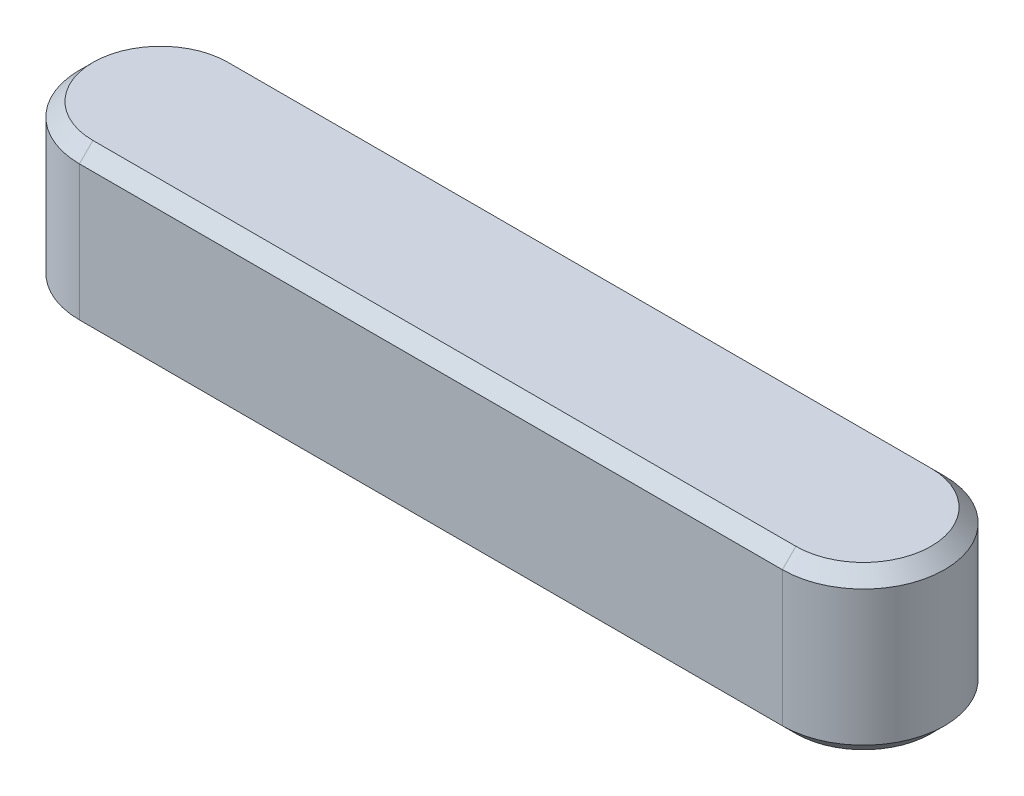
ISO-10303-21;
HEADER;
FILE_DESCRIPTION(('STEP AP214'),'2;1');
FILE_NAME('part.step','',(''),(''),'','','');
FILE_SCHEMA(('AUTOMOTIVE_DESIGN { 1 0 10303 214 1 1 1 1 }'));
ENDSEC;
DATA;
#1=APPLICATION_CONTEXT('core data for automotive mechanical design processes');
#2=APPLICATION_PROTOCOL_DEFINITION('international standard','automotive_design',2000,#1);
#3=PRODUCT_CONTEXT('',#1,'mechanical');
#4=PRODUCT('Part','Part','',(#3));
#5=PRODUCT_RELATED_PRODUCT_CATEGORY('part','',(#4));
#6=PRODUCT_DEFINITION_FORMATION('','',#4);
#7=PRODUCT_DEFINITION_CONTEXT('part definition',#1,'design');
#8=PRODUCT_DEFINITION('design','',#6,#7);
#9=PRODUCT_DEFINITION_SHAPE('','',#8);
#10=(LENGTH_UNIT() NAMED_UNIT(*) SI_UNIT(.MILLI.,.METRE.));
#11=(NAMED_UNIT(*) PLANE_ANGLE_UNIT() SI_UNIT($,.RADIAN.));
#12=(NAMED_UNIT(*) SI_UNIT($,.STERADIAN.) SOLID_ANGLE_UNIT());
#13=UNCERTAINTY_MEASURE_WITH_UNIT(LENGTH_MEASURE(1.E-05),#10,'distance_accuracy_value','');
#14=(GEOMETRIC_REPRESENTATION_CONTEXT(3) GLOBAL_UNCERTAINTY_ASSIGNED_CONTEXT((#13)) GLOBAL_UNIT_ASSIGNED_CONTEXT((#10,
#11,#12)) REPRESENTATION_CONTEXT('',''));
#15=CARTESIAN_POINT('',(0.,0.,0.));
#16=DIRECTION('',(0.,0.,1.));
#17=DIRECTION('',(1.,0.,0.));
#18=AXIS2_PLACEMENT_3D('',#15,#16,#17);
#19=CARTESIAN_POINT('',(13.,6.,0.));
#20=DIRECTION('',(0.,-1.,0.));
#21=DIRECTION('',(0.,0.,-1.));
#22=AXIS2_PLACEMENT_3D('',#19,#20,#21);
#23=CYLINDRICAL_SURFACE('',#22,2.99999999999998);
#24=DIRECTION('',(0.,-1.,0.));
#25=VECTOR('',#24,1.);
#26=CARTESIAN_POINT('',(13.,6.,-2.99999999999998));
#27=LINE('',#26,#25);
#28=CARTESIAN_POINT('',(13.,5.49999999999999,-2.99999999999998));
#29=VERTEX_POINT('',#28);
#30=CARTESIAN_POINT('',(13.,0.500000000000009,-2.99999999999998));
#31=VERTEX_POINT('',#30);
#32=EDGE_CURVE('E110',#29,#31,#27,.T.);
#33=ORIENTED_EDGE('',*,*,#32,.F.);
#34=CARTESIAN_POINT('',(13.,5.49999999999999,0.));
#35=DIRECTION('',(0.,-1.,0.));
#36=DIRECTION('',(0.,0.,-1.));
#37=AXIS2_PLACEMENT_3D('',#34,#35,#36);
#38=CIRCLE('',#37,2.99999999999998);
#39=CARTESIAN_POINT('',(13.,5.49999999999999,2.99999999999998));
#40=VERTEX_POINT('',#39);
#41=EDGE_CURVE('E134',#29,#40,#38,.T.);
#42=ORIENTED_EDGE('',*,*,#41,.T.);
#43=DIRECTION('',(0.,-1.,0.));
#44=VECTOR('',#43,1.);
#45=CARTESIAN_POINT('',(13.,6.,2.99999999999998));
#46=LINE('',#45,#44);
#47=CARTESIAN_POINT('',(13.,0.500000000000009,2.99999999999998));
#48=VERTEX_POINT('',#47);
#49=EDGE_CURVE('E161',#40,#48,#46,.T.);
#50=ORIENTED_EDGE('',*,*,#49,.T.);
#51=CARTESIAN_POINT('',(13.,0.500000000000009,0.));
#52=DIRECTION('',(0.,-1.,0.));
#53=DIRECTION('',(0.,0.,-1.));
#54=AXIS2_PLACEMENT_3D('',#51,#52,#53);
#55=CIRCLE('',#54,2.99999999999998);
#56=EDGE_CURVE('E132',#48,#31,#55,.F.);
#57=ORIENTED_EDGE('',*,*,#56,.T.);
#58=EDGE_LOOP('',(#33,#42,#50,#57));
#59=FACE_BOUND('',#58,.T.);
#60=ADVANCED_FACE('F27',(#59),#23,.T.);
#61=CARTESIAN_POINT('',(-13.,6.,-2.99999999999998));
#62=DIRECTION('',(0.,0.,1.));
#63=DIRECTION('',(1.,0.,0.));
#64=AXIS2_PLACEMENT_3D('',#61,#62,#63);
#65=PLANE('',#64);
#66=DIRECTION('',(0.,-1.,0.));
#67=VECTOR('',#66,1.);
#68=CARTESIAN_POINT('',(-13.,6.,-2.99999999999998));
#69=LINE('',#68,#67);
#70=CARTESIAN_POINT('',(-13.,5.5,-2.99999999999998));
#71=VERTEX_POINT('',#70);
#72=CARTESIAN_POINT('',(-13.,0.500000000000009,-2.99999999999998));
#73=VERTEX_POINT('',#72);
#74=EDGE_CURVE('E167',#71,#73,#69,.T.);
#75=ORIENTED_EDGE('',*,*,#74,.F.);
#76=DIRECTION('',(1.,0.,0.));
#77=VECTOR('',#76,1.);
#78=CARTESIAN_POINT('',(-13.,5.5,-2.99999999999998));
#79=LINE('',#78,#77);
#80=EDGE_CURVE('E130',#71,#29,#79,.T.);
#81=ORIENTED_EDGE('',*,*,#80,.T.);
#82=ORIENTED_EDGE('',*,*,#32,.T.);
#83=DIRECTION('',(-1.,0.,0.));
#84=VECTOR('',#83,1.);
#85=CARTESIAN_POINT('',(-13.,0.500000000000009,-2.99999999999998));
#86=LINE('',#85,#84);
#87=EDGE_CURVE('E127',#31,#73,#86,.T.);
#88=ORIENTED_EDGE('',*,*,#87,.T.);
#89=EDGE_LOOP('',(#75,#81,#82,#88));
#90=FACE_BOUND('',#89,.T.);
#91=ADVANCED_FACE('F192',(#90),#65,.F.);
#92=CARTESIAN_POINT('',(-13.,6.,0.));
#93=DIRECTION('',(0.,-1.,0.));
#94=DIRECTION('',(0.,0.,-1.));
#95=AXIS2_PLACEMENT_3D('',#92,#93,#94);
#96=CYLINDRICAL_SURFACE('',#95,2.99999999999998);
#97=DIRECTION('',(0.,-1.,0.));
#98=VECTOR('',#97,1.);
#99=CARTESIAN_POINT('',(-13.,6.,2.99999999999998));
#100=LINE('',#99,#98);
#101=CARTESIAN_POINT('',(-13.,5.5,2.99999999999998));
#102=VERTEX_POINT('',#101);
#103=CARTESIAN_POINT('',(-13.,0.500000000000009,2.99999999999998));
#104=VERTEX_POINT('',#103);
#105=EDGE_CURVE('E164',#102,#104,#100,.T.);
#106=ORIENTED_EDGE('',*,*,#105,.F.);
#107=CARTESIAN_POINT('',(-13.,5.5,0.));
#108=DIRECTION('',(0.,-1.,0.));
#109=DIRECTION('',(0.,0.,-1.));
#110=AXIS2_PLACEMENT_3D('',#107,#108,#109);
#111=CIRCLE('',#110,2.99999999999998);
#112=EDGE_CURVE('E125',#102,#71,#111,.T.);
#113=ORIENTED_EDGE('',*,*,#112,.T.);
#114=ORIENTED_EDGE('',*,*,#74,.T.);
#115=CARTESIAN_POINT('',(-13.,0.500000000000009,0.));
#116=DIRECTION('',(0.,-1.,0.));
#117=DIRECTION('',(0.,0.,-1.));
#118=AXIS2_PLACEMENT_3D('',#115,#116,#117);
#119=CIRCLE('',#118,2.99999999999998);
#120=EDGE_CURVE('E123',#73,#104,#119,.F.);
#121=ORIENTED_EDGE('',*,*,#120,.T.);
#122=EDGE_LOOP('',(#106,#113,#114,#121));
#123=FACE_BOUND('',#122,.T.);
#124=ADVANCED_FACE('F184',(#123),#96,.T.);
#125=CARTESIAN_POINT('',(-13.,6.,2.99999999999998));
#126=DIRECTION('',(0.,0.,-1.));
#127=DIRECTION('',(-1.,0.,0.));
#128=AXIS2_PLACEMENT_3D('',#125,#126,#127);
#129=PLANE('',#128);
#130=ORIENTED_EDGE('',*,*,#49,.F.);
#131=DIRECTION('',(-1.,0.,0.));
#132=VECTOR('',#131,1.);
#133=CARTESIAN_POINT('',(-13.,5.5,2.99999999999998));
#134=LINE('',#133,#132);
#135=EDGE_CURVE('E96',#40,#102,#134,.T.);
#136=ORIENTED_EDGE('',*,*,#135,.T.);
#137=ORIENTED_EDGE('',*,*,#105,.T.);
#138=DIRECTION('',(1.,0.,0.));
#139=VECTOR('',#138,1.);
#140=CARTESIAN_POINT('',(13.,0.500000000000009,2.99999999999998));
#141=LINE('',#140,#139);
#142=EDGE_CURVE('E116',#104,#48,#141,.T.);
#143=ORIENTED_EDGE('',*,*,#142,.T.);
#144=EDGE_LOOP('',(#130,#136,#137,#143));
#145=FACE_BOUND('',#144,.T.);
#146=ADVANCED_FACE('F183',(#145),#129,.F.);
#147=CARTESIAN_POINT('',(13.,6.,0.));
#148=DIRECTION('',(0.,-1.,0.));
#149=DIRECTION('',(0.,0.,-1.));
#150=AXIS2_PLACEMENT_3D('',#147,#148,#149);
#151=PLANE('',#150);
#152=CARTESIAN_POINT('',(-13.,6.,0.));
#153=DIRECTION('',(0.,-1.,0.));
#154=DIRECTION('',(0.,0.,-1.));
#155=AXIS2_PLACEMENT_3D('',#152,#153,#154);
#156=CIRCLE('',#155,2.49999999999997);
#157=CARTESIAN_POINT('',(-13.,6.,-2.49999999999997));
#158=VERTEX_POINT('',#157);
#159=CARTESIAN_POINT('',(-13.,6.,2.49999999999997));
#160=VERTEX_POINT('',#159);
#161=EDGE_CURVE('E114',#158,#160,#156,.F.);
#162=ORIENTED_EDGE('',*,*,#161,.T.);
#163=DIRECTION('',(1.,0.,0.));
#164=VECTOR('',#163,1.);
#165=CARTESIAN_POINT('',(13.,6.,2.49999999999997));
#166=LINE('',#165,#164);
#167=CARTESIAN_POINT('',(13.,6.,2.49999999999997));
#168=VERTEX_POINT('',#167);
#169=EDGE_CURVE('E94',#160,#168,#166,.T.);
#170=ORIENTED_EDGE('',*,*,#169,.T.);
#171=CARTESIAN_POINT('',(13.,6.,0.));
#172=DIRECTION('',(0.,-1.,0.));
#173=DIRECTION('',(0.,0.,-1.));
#174=AXIS2_PLACEMENT_3D('',#171,#172,#173);
#175=CIRCLE('',#174,2.49999999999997);
#176=CARTESIAN_POINT('',(13.,6.,-2.49999999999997));
#177=VERTEX_POINT('',#176);
#178=EDGE_CURVE('E103',#168,#177,#175,.F.);
#179=ORIENTED_EDGE('',*,*,#178,.T.);
#180=DIRECTION('',(-1.,0.,0.));
#181=VECTOR('',#180,1.);
#182=CARTESIAN_POINT('',(13.,6.,-2.49999999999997));
#183=LINE('',#182,#181);
#184=EDGE_CURVE('E109',#177,#158,#183,.T.);
#185=ORIENTED_EDGE('',*,*,#184,.T.);
#186=EDGE_LOOP('',(#162,#170,#179,#185));
#187=FACE_BOUND('',#186,.T.);
#188=ADVANCED_FACE('F112',(#187),#151,.F.);
#189=CARTESIAN_POINT('',(13.,0.,0.));
#190=DIRECTION('',(0.,-1.,0.));
#191=DIRECTION('',(0.,0.,-1.));
#192=AXIS2_PLACEMENT_3D('',#189,#190,#191);
#193=PLANE('',#192);
#194=CARTESIAN_POINT('',(-13.,0.,0.));
#195=DIRECTION('',(0.,-1.,0.));
#196=DIRECTION('',(0.,0.,-1.));
#197=AXIS2_PLACEMENT_3D('',#194,#195,#196);
#198=CIRCLE('',#197,2.49999999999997);
#199=CARTESIAN_POINT('',(-13.,0.,2.49999999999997));
#200=VERTEX_POINT('',#199);
#201=CARTESIAN_POINT('',(-13.,0.,-2.49999999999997));
#202=VERTEX_POINT('',#201);
#203=EDGE_CURVE('E34',#200,#202,#198,.T.);
#204=ORIENTED_EDGE('',*,*,#203,.T.);
#205=DIRECTION('',(1.,0.,0.));
#206=VECTOR('',#205,1.);
#207=CARTESIAN_POINT('',(13.,0.,-2.49999999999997));
#208=LINE('',#207,#206);
#209=CARTESIAN_POINT('',(13.,0.,-2.49999999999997));
#210=VERTEX_POINT('',#209);
#211=EDGE_CURVE('E11',#202,#210,#208,.T.);
#212=ORIENTED_EDGE('',*,*,#211,.T.);
#213=CARTESIAN_POINT('',(13.,0.,0.));
#214=DIRECTION('',(0.,-1.,0.));
#215=DIRECTION('',(0.,0.,-1.));
#216=AXIS2_PLACEMENT_3D('',#213,#214,#215);
#217=CIRCLE('',#216,2.49999999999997);
#218=CARTESIAN_POINT('',(13.,0.,2.49999999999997));
#219=VERTEX_POINT('',#218);
#220=EDGE_CURVE('E136',#210,#219,#217,.T.);
#221=ORIENTED_EDGE('',*,*,#220,.T.);
#222=DIRECTION('',(-1.,0.,0.));
#223=VECTOR('',#222,1.);
#224=CARTESIAN_POINT('',(-13.,0.,2.49999999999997));
#225=LINE('',#224,#223);
#226=EDGE_CURVE('E44',#219,#200,#225,.T.);
#227=ORIENTED_EDGE('',*,*,#226,.T.);
#228=EDGE_LOOP('',(#204,#212,#221,#227));
#229=FACE_BOUND('',#228,.T.);
#230=ADVANCED_FACE('F139',(#229),#193,.T.);
#231=CARTESIAN_POINT('',(13.,6.,-2.49999999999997));
#232=DIRECTION('',(0.,-0.707106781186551,0.707106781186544));
#233=DIRECTION('',(0.,-0.707106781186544,-0.707106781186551));
#234=AXIS2_PLACEMENT_3D('',#231,#232,#233);
#235=PLANE('',#234);
#236=DIRECTION('',(0.,0.707106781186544,0.707106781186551));
#237=VECTOR('',#236,1.);
#238=CARTESIAN_POINT('',(13.,5.5,-2.99999999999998));
#239=LINE('',#238,#237);
#240=EDGE_CURVE('E106',#29,#177,#239,.T.);
#241=ORIENTED_EDGE('',*,*,#240,.F.);
#242=ORIENTED_EDGE('',*,*,#80,.F.);
#243=DIRECTION('',(0.,-0.707106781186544,-0.707106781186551));
#244=VECTOR('',#243,1.);
#245=CARTESIAN_POINT('',(-13.,6.,-2.49999999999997));
#246=LINE('',#245,#244);
#247=EDGE_CURVE('E158',#158,#71,#246,.T.);
#248=ORIENTED_EDGE('',*,*,#247,.F.);
#249=ORIENTED_EDGE('',*,*,#184,.F.);
#250=EDGE_LOOP('',(#241,#242,#248,#249));
#251=FACE_BOUND('',#250,.T.);
#252=ADVANCED_FACE('F174',(#251),#235,.F.);
#253=CARTESIAN_POINT('',(-13.,6.,0.));
#254=DIRECTION('',(0.,-1.,0.));
#255=DIRECTION('',(0.,0.,-1.));
#256=AXIS2_PLACEMENT_3D('',#253,#254,#255);
#257=CONICAL_SURFACE('',#256,2.49999999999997,0.785398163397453);
#258=ORIENTED_EDGE('',*,*,#247,.T.);
#259=ORIENTED_EDGE('',*,*,#112,.F.);
#260=DIRECTION('',(0.,-0.707106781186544,0.707106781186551));
#261=VECTOR('',#260,1.);
#262=CARTESIAN_POINT('',(-13.,6.,2.49999999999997));
#263=LINE('',#262,#261);
#264=EDGE_CURVE('E99',#160,#102,#263,.T.);
#265=ORIENTED_EDGE('',*,*,#264,.F.);
#266=ORIENTED_EDGE('',*,*,#161,.F.);
#267=EDGE_LOOP('',(#258,#259,#265,#266));
#268=FACE_BOUND('',#267,.T.);
#269=ADVANCED_FACE('F177',(#268),#257,.T.);
#270=CARTESIAN_POINT('',(13.,6.,0.));
#271=DIRECTION('',(0.,-1.,0.));
#272=DIRECTION('',(0.,0.,-1.));
#273=AXIS2_PLACEMENT_3D('',#270,#271,#272);
#274=CONICAL_SURFACE('',#273,2.49999999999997,0.785398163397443);
#275=ORIENTED_EDGE('',*,*,#240,.T.);
#276=ORIENTED_EDGE('',*,*,#178,.F.);
#277=DIRECTION('',(0.,0.707106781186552,-0.707106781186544));
#278=VECTOR('',#277,1.);
#279=CARTESIAN_POINT('',(13.,5.49999999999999,2.99999999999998));
#280=LINE('',#279,#278);
#281=EDGE_CURVE('E90',#40,#168,#280,.T.);
#282=ORIENTED_EDGE('',*,*,#281,.F.);
#283=ORIENTED_EDGE('',*,*,#41,.F.);
#284=EDGE_LOOP('',(#275,#276,#282,#283));
#285=FACE_BOUND('',#284,.T.);
#286=ADVANCED_FACE('F104',(#285),#274,.T.);
#287=CARTESIAN_POINT('',(13.,6.,2.49999999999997));
#288=DIRECTION('',(0.,-0.707106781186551,-0.707106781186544));
#289=DIRECTION('',(0.,0.707106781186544,-0.707106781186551));
#290=AXIS2_PLACEMENT_3D('',#287,#288,#289);
#291=PLANE('',#290);
#292=ORIENTED_EDGE('',*,*,#264,.T.);
#293=ORIENTED_EDGE('',*,*,#135,.F.);
#294=ORIENTED_EDGE('',*,*,#281,.T.);
#295=ORIENTED_EDGE('',*,*,#169,.F.);
#296=EDGE_LOOP('',(#292,#293,#294,#295));
#297=FACE_BOUND('',#296,.T.);
#298=ADVANCED_FACE('F92',(#297),#291,.F.);
#299=CARTESIAN_POINT('',(-13.,0.500000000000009,2.99999999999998));
#300=DIRECTION('',(0.,-0.707106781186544,0.707106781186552));
#301=DIRECTION('',(0.,-0.707106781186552,-0.707106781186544));
#302=AXIS2_PLACEMENT_3D('',#299,#300,#301);
#303=PLANE('',#302);
#304=DIRECTION('',(0.,0.707106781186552,0.707106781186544));
#305=VECTOR('',#304,1.);
#306=CARTESIAN_POINT('',(-13.,0.,2.49999999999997));
#307=LINE('',#306,#305);
#308=EDGE_CURVE('E149',#200,#104,#307,.T.);
#309=ORIENTED_EDGE('',*,*,#308,.F.);
#310=ORIENTED_EDGE('',*,*,#226,.F.);
#311=DIRECTION('',(0.,-0.707106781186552,-0.707106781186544));
#312=VECTOR('',#311,1.);
#313=CARTESIAN_POINT('',(13.,0.500000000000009,2.99999999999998));
#314=LINE('',#313,#312);
#315=EDGE_CURVE('E100',#48,#219,#314,.T.);
#316=ORIENTED_EDGE('',*,*,#315,.F.);
#317=ORIENTED_EDGE('',*,*,#142,.F.);
#318=EDGE_LOOP('',(#309,#310,#316,#317));
#319=FACE_BOUND('',#318,.T.);
#320=ADVANCED_FACE('F145',(#319),#303,.T.);
#321=CARTESIAN_POINT('',(13.,0.500000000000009,0.));
#322=DIRECTION('',(0.,1.,0.));
#323=DIRECTION('',(0.,0.,1.));
#324=AXIS2_PLACEMENT_3D('',#321,#322,#323);
#325=CONICAL_SURFACE('',#324,2.99999999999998,0.785398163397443);
#326=ORIENTED_EDGE('',*,*,#315,.T.);
#327=ORIENTED_EDGE('',*,*,#220,.F.);
#328=DIRECTION('',(0.,-0.707106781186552,0.707106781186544));
#329=VECTOR('',#328,1.);
#330=CARTESIAN_POINT('',(13.,0.500000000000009,-2.99999999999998));
#331=LINE('',#330,#329);
#332=EDGE_CURVE('E152',#31,#210,#331,.T.);
#333=ORIENTED_EDGE('',*,*,#332,.F.);
#334=ORIENTED_EDGE('',*,*,#56,.F.);
#335=EDGE_LOOP('',(#326,#327,#333,#334));
#336=FACE_BOUND('',#335,.T.);
#337=ADVANCED_FACE('F150',(#336),#325,.T.);
#338=CARTESIAN_POINT('',(-13.,0.500000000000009,0.));
#339=DIRECTION('',(0.,1.,0.));
#340=DIRECTION('',(0.,0.,1.));
#341=AXIS2_PLACEMENT_3D('',#338,#339,#340);
#342=CONICAL_SURFACE('',#341,2.99999999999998,0.785398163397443);
#343=ORIENTED_EDGE('',*,*,#308,.T.);
#344=ORIENTED_EDGE('',*,*,#120,.F.);
#345=DIRECTION('',(0.,0.707106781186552,-0.707106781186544));
#346=VECTOR('',#345,1.);
#347=CARTESIAN_POINT('',(-13.,0.,-2.49999999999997));
#348=LINE('',#347,#346);
#349=EDGE_CURVE('E189',#202,#73,#348,.T.);
#350=ORIENTED_EDGE('',*,*,#349,.F.);
#351=ORIENTED_EDGE('',*,*,#203,.F.);
#352=EDGE_LOOP('',(#343,#344,#350,#351));
#353=FACE_BOUND('',#352,.T.);
#354=ADVANCED_FACE('F188',(#353),#342,.T.);
#355=CARTESIAN_POINT('',(-13.,0.500000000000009,-2.99999999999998));
#356=DIRECTION('',(0.,-0.707106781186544,-0.707106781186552));
#357=DIRECTION('',(0.,0.707106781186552,-0.707106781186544));
#358=AXIS2_PLACEMENT_3D('',#355,#356,#357);
#359=PLANE('',#358);
#360=ORIENTED_EDGE('',*,*,#332,.T.);
#361=ORIENTED_EDGE('',*,*,#211,.F.);
#362=ORIENTED_EDGE('',*,*,#349,.T.);
#363=ORIENTED_EDGE('',*,*,#87,.F.);
#364=EDGE_LOOP('',(#360,#361,#362,#363));
#365=FACE_BOUND('',#364,.T.);
#366=ADVANCED_FACE('F195',(#365),#359,.T.);
#367=CLOSED_SHELL('',(#60,#91,#124,#146,#188,#230,#252,#269,#286,#298,#320,#337,#354,#366));
#368=MANIFOLD_SOLID_BREP('B2',#367);
#369=ADVANCED_BREP_SHAPE_REPRESENTATION('',(#18,#368),#14);
#370=SHAPE_DEFINITION_REPRESENTATION(#9,#369);
ENDSEC;
END-ISO-10303-21;
